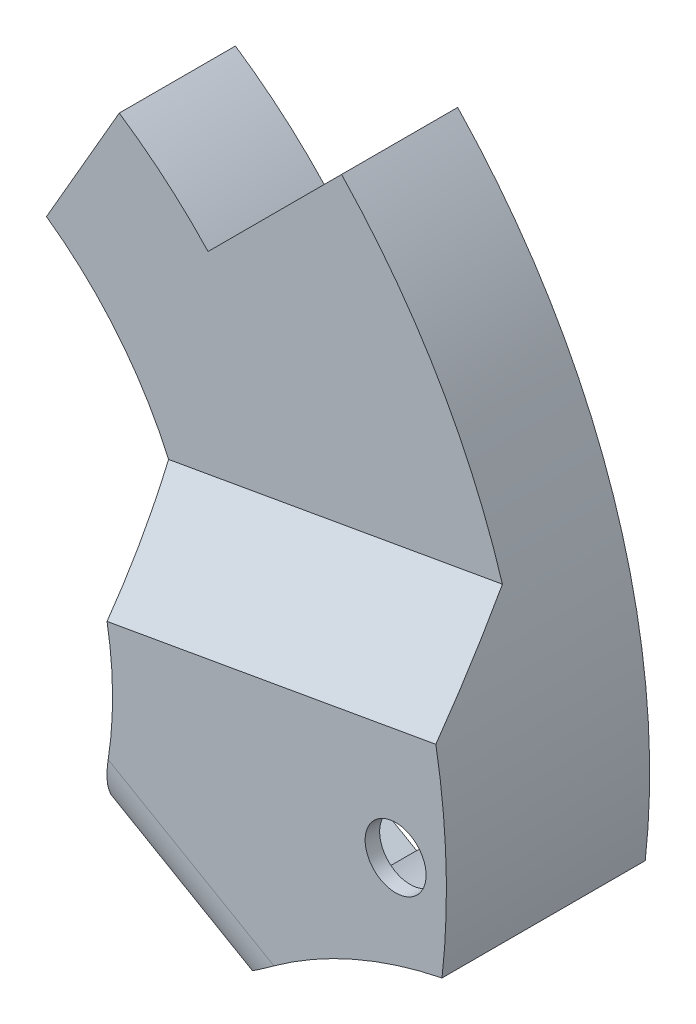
ISO-10303-21;
HEADER;
FILE_DESCRIPTION(('STEP AP214'),'2;1');
FILE_NAME('part.step','',(''),(''),'','','');
FILE_SCHEMA(('AUTOMOTIVE_DESIGN { 1 0 10303 214 1 1 1 1 }'));
ENDSEC;
DATA;
#1=APPLICATION_CONTEXT('core data for automotive mechanical design processes');
#2=APPLICATION_PROTOCOL_DEFINITION('international standard','automotive_design',2000,#1);
#3=PRODUCT_CONTEXT('',#1,'mechanical');
#4=PRODUCT('Part','Part','',(#3));
#5=PRODUCT_RELATED_PRODUCT_CATEGORY('part','',(#4));
#6=PRODUCT_DEFINITION_FORMATION('','',#4);
#7=PRODUCT_DEFINITION_CONTEXT('part definition',#1,'design');
#8=PRODUCT_DEFINITION('design','',#6,#7);
#9=PRODUCT_DEFINITION_SHAPE('','',#8);
#10=(LENGTH_UNIT() NAMED_UNIT(*) SI_UNIT(.MILLI.,.METRE.));
#11=(NAMED_UNIT(*) PLANE_ANGLE_UNIT() SI_UNIT($,.RADIAN.));
#12=(NAMED_UNIT(*) SI_UNIT($,.STERADIAN.) SOLID_ANGLE_UNIT());
#13=UNCERTAINTY_MEASURE_WITH_UNIT(LENGTH_MEASURE(1.E-05),#10,'distance_accuracy_value','');
#14=(GEOMETRIC_REPRESENTATION_CONTEXT(3) GLOBAL_UNCERTAINTY_ASSIGNED_CONTEXT((#13)) GLOBAL_UNIT_ASSIGNED_CONTEXT((#10,
#11,#12)) REPRESENTATION_CONTEXT('',''));
#15=CARTESIAN_POINT('',(0.,0.,0.));
#16=DIRECTION('',(0.,0.,1.));
#17=DIRECTION('',(1.,0.,0.));
#18=AXIS2_PLACEMENT_3D('',#15,#16,#17);
#19=CARTESIAN_POINT('',(0.,0.,0.));
#20=DIRECTION('',(0.,0.,1.));
#21=DIRECTION('',(1.,0.,0.));
#22=AXIS2_PLACEMENT_3D('',#19,#20,#21);
#23=PLANE('',#22);
#24=DIRECTION('',(0.500000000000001,0.866025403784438,0.));
#25=VECTOR('',#24,1.);
#26=CARTESIAN_POINT('',(1.99999999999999,-1.15470053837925,0.));
#27=LINE('',#26,#25);
#28=CARTESIAN_POINT('',(14.4465524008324,20.4033605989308,0.));
#29=VERTEX_POINT('',#28);
#30=CARTESIAN_POINT('',(14.8942609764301,21.1788145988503,0.));
#31=VERTEX_POINT('',#30);
#32=EDGE_CURVE('E208',#29,#31,#27,.T.);
#33=ORIENTED_EDGE('',*,*,#32,.T.);
#34=DIRECTION('',(0.866025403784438,-0.500000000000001,0.));
#35=VECTOR('',#34,1.);
#36=CARTESIAN_POINT('',(7.10003234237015,25.6788145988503,0.));
#37=LINE('',#36,#35);
#38=CARTESIAN_POINT('',(15.7602863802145,20.6788145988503,0.));
#39=VERTEX_POINT('',#38);
#40=EDGE_CURVE('E190',#31,#39,#37,.T.);
#41=ORIENTED_EDGE('',*,*,#40,.T.);
#42=CARTESIAN_POINT('',(0.,0.,0.));
#43=DIRECTION('',(0.,0.,1.));
#44=DIRECTION('',(1.,0.,0.));
#45=AXIS2_PLACEMENT_3D('',#42,#43,#44);
#46=CIRCLE('',#45,26.);
#47=CARTESIAN_POINT('',(24.5963797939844,-8.42722380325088,0.));
#48=VERTEX_POINT('',#47);
#49=EDGE_CURVE('E205',#48,#39,#46,.T.);
#50=ORIENTED_EDGE('',*,*,#49,.F.);
#51=DIRECTION('',(0.866025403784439,-0.5,0.));
#52=VECTOR('',#51,1.);
#53=CARTESIAN_POINT('',(2.5,4.33012701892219,0.));
#54=LINE('',#53,#52);
#55=CARTESIAN_POINT('',(31.9456580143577,-12.6703315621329,0.));
#56=VERTEX_POINT('',#55);
#57=EDGE_CURVE('E215',#48,#56,#54,.T.);
#58=ORIENTED_EDGE('',*,*,#57,.T.);
#59=CARTESIAN_POINT('',(53.6576621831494,-34.7969868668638,0.));
#60=DIRECTION('',(0.,0.,1.));
#61=DIRECTION('',(1.,0.,0.));
#62=AXIS2_PLACEMENT_3D('',#59,#60,#61);
#63=CIRCLE('',#62,31.);
#64=CARTESIAN_POINT('',(46.7772756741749,-4.57017291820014,0.));
#65=VERTEX_POINT('',#64);
#66=EDGE_CURVE('E218',#56,#65,#63,.F.);
#67=ORIENTED_EDGE('',*,*,#66,.T.);
#68=CARTESIAN_POINT('',(0.,0.,0.));
#69=DIRECTION('',(0.,0.,1.));
#70=DIRECTION('',(1.,0.,0.));
#71=AXIS2_PLACEMENT_3D('',#68,#69,#70);
#72=CIRCLE('',#71,47.);
#73=CARTESIAN_POINT('',(34.7501476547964,31.6453351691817,0.));
#74=VERTEX_POINT('',#73);
#75=EDGE_CURVE('E354',#65,#74,#72,.T.);
#76=ORIENTED_EDGE('',*,*,#75,.T.);
#77=DIRECTION('',(0.707106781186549,0.707106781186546,0.));
#78=VECTOR('',#77,1.);
#79=CARTESIAN_POINT('',(1.55240624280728,-1.55240624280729,0.));
#80=LINE('',#79,#78);
#81=CARTESIAN_POINT('',(25.5438637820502,22.4390512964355,0.));
#82=VERTEX_POINT('',#81);
#83=EDGE_CURVE('E221',#82,#74,#80,.T.);
#84=ORIENTED_EDGE('',*,*,#83,.F.);
#85=CARTESIAN_POINT('',(0.,0.,0.));
#86=DIRECTION('',(0.,0.,1.));
#87=DIRECTION('',(1.,0.,0.));
#88=AXIS2_PLACEMENT_3D('',#85,#86,#87);
#89=CIRCLE('',#88,34.);
#90=CARTESIAN_POINT('',(19.7853033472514,27.650348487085,0.));
#91=VERTEX_POINT('',#90);
#92=EDGE_CURVE('E216',#82,#91,#89,.T.);
#93=ORIENTED_EDGE('',*,*,#92,.T.);
#94=DIRECTION('',(0.866025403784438,-0.500000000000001,0.));
#95=VECTOR('',#94,1.);
#96=CARTESIAN_POINT('',(11.125049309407,32.650348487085,0.));
#97=LINE('',#96,#95);
#98=CARTESIAN_POINT('',(18.919277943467,28.150348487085,0.));
#99=VERTEX_POINT('',#98);
#100=EDGE_CURVE('E209',#99,#91,#97,.T.);
#101=ORIENTED_EDGE('',*,*,#100,.F.);
#102=CARTESIAN_POINT('',(19.4618632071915,29.090133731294,0.));
#103=VERTEX_POINT('',#102);
#104=EDGE_CURVE('E257',#99,#103,#27,.T.);
#105=ORIENTED_EDGE('',*,*,#104,.T.);
#106=CARTESIAN_POINT('',(0.,0.,0.));
#107=DIRECTION('',(0.,0.,1.));
#108=DIRECTION('',(1.,0.,0.));
#109=AXIS2_PLACEMENT_3D('',#106,#107,#108);
#110=CIRCLE('',#109,35.);
#111=CARTESIAN_POINT('',(25.5795968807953,23.8889979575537,0.));
#112=VERTEX_POINT('',#111);
#113=EDGE_CURVE('E254',#112,#103,#110,.T.);
#114=ORIENTED_EDGE('',*,*,#113,.F.);
#115=DIRECTION('',(0.707106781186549,0.707106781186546,0.));
#116=VECTOR('',#115,1.);
#117=CARTESIAN_POINT('',(0.845299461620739,-0.845299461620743,0.));
#118=LINE('',#117,#116);
#119=CARTESIAN_POINT('',(34.7758972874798,33.0852983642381,0.));
#120=VERTEX_POINT('',#119);
#121=EDGE_CURVE('E237',#112,#120,#118,.T.);
#122=ORIENTED_EDGE('',*,*,#121,.T.);
#123=CARTESIAN_POINT('',(0.,0.,0.));
#124=DIRECTION('',(0.,0.,1.));
#125=DIRECTION('',(1.,0.,0.));
#126=AXIS2_PLACEMENT_3D('',#123,#124,#125);
#127=CIRCLE('',#126,48.);
#128=CARTESIAN_POINT('',(47.6958091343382,-5.39534901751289,0.));
#129=VERTEX_POINT('',#128);
#130=EDGE_CURVE('E242',#129,#120,#127,.T.);
#131=ORIENTED_EDGE('',*,*,#130,.F.);
#132=CARTESIAN_POINT('',(53.6576621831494,-34.7969868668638,0.));
#133=DIRECTION('',(0.,0.,1.));
#134=DIRECTION('',(1.,0.,0.));
#135=AXIS2_PLACEMENT_3D('',#132,#133,#134);
#136=CIRCLE('',#135,30.);
#137=CARTESIAN_POINT('',(32.1122898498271,-13.921237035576,0.));
#138=VERTEX_POINT('',#137);
#139=EDGE_CURVE('E264',#138,#129,#136,.F.);
#140=ORIENTED_EDGE('',*,*,#139,.F.);
#141=DIRECTION('',(0.866025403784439,-0.5,0.));
#142=VECTOR('',#141,1.);
#143=CARTESIAN_POINT('',(2.,3.46410161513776,0.));
#144=LINE('',#143,#142);
#145=CARTESIAN_POINT('',(23.3717102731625,-8.87486106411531,0.));
#146=VERTEX_POINT('',#145);
#147=EDGE_CURVE('E261',#146,#138,#144,.T.);
#148=ORIENTED_EDGE('',*,*,#147,.F.);
#149=CARTESIAN_POINT('',(0.,0.,0.));
#150=DIRECTION('',(0.,0.,1.));
#151=DIRECTION('',(1.,0.,0.));
#152=AXIS2_PLACEMENT_3D('',#149,#150,#151);
#153=CIRCLE('',#152,25.);
#154=EDGE_CURVE('E259',#146,#29,#153,.T.);
#155=ORIENTED_EDGE('',*,*,#154,.T.);
#156=EDGE_LOOP('',(#33,#41,#50,#58,#67,#76,#84,#93,#101,#105,#114,#122,#131,#140,#148,#155));
#157=FACE_BOUND('',#156,.T.);
#158=ADVANCED_FACE('F38',(#157),#23,.F.);
#159=CARTESIAN_POINT('',(0.,0.,8.));
#160=DIRECTION('',(0.,0.,1.));
#161=DIRECTION('',(1.,0.,0.));
#162=AXIS2_PLACEMENT_3D('',#159,#160,#161);
#163=PLANE('',#162);
#164=CARTESIAN_POINT('',(0.,0.,8.));
#165=DIRECTION('',(0.,0.,1.));
#166=DIRECTION('',(1.,0.,0.));
#167=AXIS2_PLACEMENT_3D('',#164,#165,#166);
#168=CIRCLE('',#167,25.);
#169=CARTESIAN_POINT('',(22.8587275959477,10.1231700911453,8.));
#170=VERTEX_POINT('',#169);
#171=CARTESIAN_POINT('',(14.4465524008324,20.4033605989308,8.));
#172=VERTEX_POINT('',#171);
#173=EDGE_CURVE('E247',#170,#172,#168,.T.);
#174=ORIENTED_EDGE('',*,*,#173,.F.);
#175=DIRECTION('',(0.984807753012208,0.173648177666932,0.));
#176=VECTOR('',#175,1.);
#177=CARTESIAN_POINT('',(46.2288830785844,14.243959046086,8.));
#178=LINE('',#177,#176);
#179=CARTESIAN_POINT('',(45.8581262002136,14.178584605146,8.));
#180=VERTEX_POINT('',#179);
#181=EDGE_CURVE('E283',#170,#180,#178,.T.);
#182=ORIENTED_EDGE('',*,*,#181,.T.);
#183=CARTESIAN_POINT('',(0.,0.,8.));
#184=DIRECTION('',(0.,0.,1.));
#185=DIRECTION('',(1.,0.,0.));
#186=AXIS2_PLACEMENT_3D('',#183,#184,#185);
#187=CIRCLE('',#186,48.);
#188=CARTESIAN_POINT('',(34.7758972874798,33.0852983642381,8.));
#189=VERTEX_POINT('',#188);
#190=EDGE_CURVE('E249',#180,#189,#187,.T.);
#191=ORIENTED_EDGE('',*,*,#190,.T.);
#192=DIRECTION('',(0.707106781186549,0.707106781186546,0.));
#193=VECTOR('',#192,1.);
#194=CARTESIAN_POINT('',(0.845299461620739,-0.845299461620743,8.));
#195=LINE('',#194,#193);
#196=CARTESIAN_POINT('',(25.5795968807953,23.8889979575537,8.));
#197=VERTEX_POINT('',#196);
#198=EDGE_CURVE('E238',#197,#189,#195,.T.);
#199=ORIENTED_EDGE('',*,*,#198,.F.);
#200=CARTESIAN_POINT('',(0.,0.,8.));
#201=DIRECTION('',(0.,0.,1.));
#202=DIRECTION('',(1.,0.,0.));
#203=AXIS2_PLACEMENT_3D('',#200,#201,#202);
#204=CIRCLE('',#203,35.);
#205=CARTESIAN_POINT('',(19.4618632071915,29.090133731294,8.));
#206=VERTEX_POINT('',#205);
#207=EDGE_CURVE('E241',#197,#206,#204,.T.);
#208=ORIENTED_EDGE('',*,*,#207,.T.);
#209=DIRECTION('',(0.500000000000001,0.866025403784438,0.));
#210=VECTOR('',#209,1.);
#211=CARTESIAN_POINT('',(1.99999999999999,-1.15470053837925,8.));
#212=LINE('',#211,#210);
#213=EDGE_CURVE('E244',#172,#206,#212,.T.);
#214=ORIENTED_EDGE('',*,*,#213,.F.);
#215=EDGE_LOOP('',(#174,#182,#191,#199,#208,#214));
#216=FACE_BOUND('',#215,.T.);
#217=ADVANCED_FACE('F479',(#216),#163,.T.);
#218=CARTESIAN_POINT('',(0.845299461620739,-0.845299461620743,8.));
#219=DIRECTION('',(-0.707106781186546,0.707106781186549,0.));
#220=DIRECTION('',(-0.707106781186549,-0.707106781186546,0.));
#221=AXIS2_PLACEMENT_3D('',#218,#219,#220);
#222=PLANE('',#221);
#223=ORIENTED_EDGE('',*,*,#121,.F.);
#224=DIRECTION('',(0.,0.,-1.));
#225=VECTOR('',#224,1.);
#226=CARTESIAN_POINT('',(25.5795968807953,23.8889979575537,8.));
#227=LINE('',#226,#225);
#228=EDGE_CURVE('E281',#197,#112,#227,.T.);
#229=ORIENTED_EDGE('',*,*,#228,.F.);
#230=ORIENTED_EDGE('',*,*,#198,.T.);
#231=DIRECTION('',(0.,0.,-1.));
#232=VECTOR('',#231,1.);
#233=CARTESIAN_POINT('',(34.7758972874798,33.0852983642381,8.));
#234=LINE('',#233,#232);
#235=EDGE_CURVE('E251',#189,#120,#234,.T.);
#236=ORIENTED_EDGE('',*,*,#235,.T.);
#237=EDGE_LOOP('',(#223,#229,#230,#236));
#238=FACE_BOUND('',#237,.T.);
#239=ADVANCED_FACE('F455',(#238),#222,.T.);
#240=CARTESIAN_POINT('',(0.,0.,8.));
#241=DIRECTION('',(0.,0.,-1.));
#242=DIRECTION('',(-1.,0.,0.));
#243=AXIS2_PLACEMENT_3D('',#240,#241,#242);
#244=CYLINDRICAL_SURFACE('',#243,35.);
#245=ORIENTED_EDGE('',*,*,#113,.T.);
#246=DIRECTION('',(0.,0.,-1.));
#247=VECTOR('',#246,1.);
#248=CARTESIAN_POINT('',(19.4618632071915,29.090133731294,8.));
#249=LINE('',#248,#247);
#250=EDGE_CURVE('E278',#206,#103,#249,.T.);
#251=ORIENTED_EDGE('',*,*,#250,.F.);
#252=ORIENTED_EDGE('',*,*,#207,.F.);
#253=ORIENTED_EDGE('',*,*,#228,.T.);
#254=EDGE_LOOP('',(#245,#251,#252,#253));
#255=FACE_BOUND('',#254,.T.);
#256=ADVANCED_FACE('F481',(#255),#244,.T.);
#257=CARTESIAN_POINT('',(1.99999999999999,-1.15470053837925,8.));
#258=DIRECTION('',(-0.866025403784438,0.500000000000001,0.));
#259=DIRECTION('',(-0.500000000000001,-0.866025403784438,0.));
#260=AXIS2_PLACEMENT_3D('',#257,#258,#259);
#261=PLANE('',#260);
#262=DIRECTION('',(0.,0.,1.));
#263=VECTOR('',#262,1.);
#264=CARTESIAN_POINT('',(14.8942609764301,21.1788145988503,8.));
#265=LINE('',#264,#263);
#266=CARTESIAN_POINT('',(14.8942609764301,21.1788145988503,7.));
#267=VERTEX_POINT('',#266);
#268=EDGE_CURVE('E443',#31,#267,#265,.T.);
#269=ORIENTED_EDGE('',*,*,#268,.F.);
#270=ORIENTED_EDGE('',*,*,#32,.F.);
#271=DIRECTION('',(0.,0.,-1.));
#272=VECTOR('',#271,1.);
#273=CARTESIAN_POINT('',(14.4465524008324,20.4033605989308,8.));
#274=LINE('',#273,#272);
#275=EDGE_CURVE('E276',#172,#29,#274,.T.);
#276=ORIENTED_EDGE('',*,*,#275,.F.);
#277=ORIENTED_EDGE('',*,*,#213,.T.);
#278=ORIENTED_EDGE('',*,*,#250,.T.);
#279=ORIENTED_EDGE('',*,*,#104,.F.);
#280=DIRECTION('',(0.,0.,-1.));
#281=VECTOR('',#280,1.);
#282=CARTESIAN_POINT('',(18.919277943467,28.150348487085,8.));
#283=LINE('',#282,#281);
#284=CARTESIAN_POINT('',(18.919277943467,28.150348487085,7.));
#285=VERTEX_POINT('',#284);
#286=EDGE_CURVE('E336',#285,#99,#283,.T.);
#287=ORIENTED_EDGE('',*,*,#286,.F.);
#288=DIRECTION('',(0.500000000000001,0.866025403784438,0.));
#289=VECTOR('',#288,1.);
#290=CARTESIAN_POINT('',(1.99999999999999,-1.15470053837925,7.));
#291=LINE('',#290,#289);
#292=EDGE_CURVE('E441',#267,#285,#291,.T.);
#293=ORIENTED_EDGE('',*,*,#292,.F.);
#294=EDGE_LOOP('',(#269,#270,#276,#277,#278,#279,#287,#293));
#295=FACE_BOUND('',#294,.T.);
#296=ADVANCED_FACE('F314',(#295),#261,.T.);
#297=CARTESIAN_POINT('',(0.,0.,8.));
#298=DIRECTION('',(0.,0.,-1.));
#299=DIRECTION('',(-1.,0.,0.));
#300=AXIS2_PLACEMENT_3D('',#297,#298,#299);
#301=CYLINDRICAL_SURFACE('',#300,25.);
#302=DIRECTION('',(0.,0.,-1.));
#303=VECTOR('',#302,1.);
#304=CARTESIAN_POINT('',(23.3717102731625,-8.87486106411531,8.));
#305=LINE('',#304,#303);
#306=CARTESIAN_POINT('',(23.3717102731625,-8.87486106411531,9.));
#307=VERTEX_POINT('',#306);
#308=EDGE_CURVE('E274',#307,#146,#305,.T.);
#309=ORIENTED_EDGE('',*,*,#308,.F.);
#310=CARTESIAN_POINT('',(23.3717102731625,-8.87486106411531,9.));
#311=CARTESIAN_POINT('',(23.3716969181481,-8.87487172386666,9.13876717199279));
#312=CARTESIAN_POINT('',(23.3737873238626,-8.86939043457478,9.27753236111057));
#313=CARTESIAN_POINT('',(23.382079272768,-8.84752066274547,9.55407116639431));
#314=CARTESIAN_POINT('',(23.3882806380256,-8.83113265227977,9.69184482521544));
#315=CARTESIAN_POINT('',(23.4046917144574,-8.78754319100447,9.96531811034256));
#316=CARTESIAN_POINT('',(23.4148982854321,-8.76035021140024,10.10101927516));
#317=CARTESIAN_POINT('',(23.4391319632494,-8.69530358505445,10.3694918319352));
#318=CARTESIAN_POINT('',(23.4531590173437,-8.65745008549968,10.5022632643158));
#319=CARTESIAN_POINT('',(23.484788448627,-8.57127847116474,10.7639788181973));
#320=CARTESIAN_POINT('',(23.5023920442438,-8.52295678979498,10.8929216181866));
#321=CARTESIAN_POINT('',(23.5408632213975,-8.41611443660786,11.1460626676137));
#322=CARTESIAN_POINT('',(23.5617320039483,-8.35759001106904,11.270259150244));
#323=CARTESIAN_POINT('',(23.6063446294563,-8.23073560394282,11.5129098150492));
#324=CARTESIAN_POINT('',(23.6300868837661,-8.16241103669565,11.6313671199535));
#325=CARTESIAN_POINT('',(23.680045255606,-8.01632182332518,11.8618224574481));
#326=CARTESIAN_POINT('',(23.7062622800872,-7.93855371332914,11.9738180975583));
#327=CARTESIAN_POINT('',(23.7606869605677,-7.77413955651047,12.1904566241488));
#328=CARTESIAN_POINT('',(23.7888933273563,-7.68749924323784,12.295104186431));
#329=CARTESIAN_POINT('',(23.8468376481,-7.50582608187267,12.4964551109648));
#330=CARTESIAN_POINT('',(23.8765761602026,-7.41079016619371,12.5931555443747));
#331=CARTESIAN_POINT('',(23.9370627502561,-7.21302377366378,12.7779012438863));
#332=CARTESIAN_POINT('',(23.9678104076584,-7.11029647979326,12.8659500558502));
#333=CARTESIAN_POINT('',(24.029836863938,-6.89776749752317,13.0329265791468));
#334=CARTESIAN_POINT('',(24.0611158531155,-6.78796323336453,13.1118509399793));
#335=CARTESIAN_POINT('',(24.1239206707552,-6.56127853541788,13.2606091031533));
#336=CARTESIAN_POINT('',(24.1554467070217,-6.44435431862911,13.3303760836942));
#337=CARTESIAN_POINT('',(24.2180640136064,-6.20489311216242,13.4598427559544));
#338=CARTESIAN_POINT('',(24.2491551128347,-6.08235399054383,13.5195385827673));
#339=CARTESIAN_POINT('',(24.3104506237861,-5.83253966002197,13.6285821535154));
#340=CARTESIAN_POINT('',(24.3406550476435,-5.70526451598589,13.6779300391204));
#341=CARTESIAN_POINT('',(24.3997868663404,-5.44683492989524,13.7661421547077));
#342=CARTESIAN_POINT('',(24.4287138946,-5.31567939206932,13.8050033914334));
#343=CARTESIAN_POINT('',(24.5021715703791,-4.96902824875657,13.8927430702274));
#344=CARTESIAN_POINT('',(24.5454162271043,-4.7510437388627,13.9331949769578));
#345=CARTESIAN_POINT('',(24.6061971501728,-4.42126754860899,13.973408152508));
#346=CARTESIAN_POINT('',(24.6257622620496,-4.31096597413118,13.9834019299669));
#347=CARTESIAN_POINT('',(24.6634708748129,-4.08971833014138,13.9966961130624));
#348=CARTESIAN_POINT('',(24.6816143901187,-3.97877226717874,13.9999965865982));
#349=CARTESIAN_POINT('',(24.6990098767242,-3.86767515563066,14.));
#350=B_SPLINE_CURVE_WITH_KNOTS('',3,(#310,#311,#312,#313,#314,#315,#316,#317,#318,#319,#320,
#321,#322,#323,#324,#325,#326,#327,#328,#329,#330,#331,#332,#333,#334,#335,#336,#337,#338,#339,
#340,#341,#342,#343,#344,#345,#346,#347,#348,#349),.UNSPECIFIED.,.F.,.F.,(4,2,2,2,2,2,2,2,2,2,2,
2,2,2,2,2,2,2,2,4),(0.,0.416174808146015,0.832331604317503,1.24816277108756,1.66398819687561,
2.07995552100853,2.49607620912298,2.91196787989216,3.32801256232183,3.74379005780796,
4.15972010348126,4.57547896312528,4.99139000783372,5.41018470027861,5.82913974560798,
6.24808905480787,6.66715782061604,7.34271700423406,7.679951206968,8.01718198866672),.UNSPECIFIED.);
#351=CARTESIAN_POINT('',(24.6990098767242,-3.86767515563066,14.));
#352=VERTEX_POINT('',#351);
#353=EDGE_CURVE('E47',#307,#352,#350,.T.);
#354=ORIENTED_EDGE('',*,*,#353,.T.);
#355=CARTESIAN_POINT('',(0.,0.,14.));
#356=DIRECTION('',(0.,0.,1.));
#357=DIRECTION('',(1.,0.,0.));
#358=AXIS2_PLACEMENT_3D('',#355,#356,#357);
#359=CIRCLE('',#358,25.);
#360=CARTESIAN_POINT('',(24.6201938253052,4.34120444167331,14.));
#361=VERTEX_POINT('',#360);
#362=EDGE_CURVE('E228',#361,#352,#359,.F.);
#363=ORIENTED_EDGE('',*,*,#362,.F.);
#364=CARTESIAN_POINT('',(0.,0.,14.));
#365=DIRECTION('',(-0.122787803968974,0.696364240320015,0.707106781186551));
#366=DIRECTION('',(-0.122787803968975,0.696364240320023,-0.707106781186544));
#367=AXIS2_PLACEMENT_3D('',#364,#365,#366);
#368=ELLIPSE('',#367,35.3553390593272,25.);
#369=EDGE_CURVE('E288',#361,#170,#368,.T.);
#370=ORIENTED_EDGE('',*,*,#369,.T.);
#371=ORIENTED_EDGE('',*,*,#173,.T.);
#372=ORIENTED_EDGE('',*,*,#275,.T.);
#373=ORIENTED_EDGE('',*,*,#154,.F.);
#374=EDGE_LOOP('',(#309,#354,#363,#370,#371,#372,#373));
#375=FACE_BOUND('',#374,.T.);
#376=ADVANCED_FACE('F310',(#375),#301,.F.);
#377=CARTESIAN_POINT('',(2.,3.46410161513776,8.));
#378=DIRECTION('',(0.5,0.866025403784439,0.));
#379=DIRECTION('',(-0.866025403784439,0.5,0.));
#380=AXIS2_PLACEMENT_3D('',#377,#378,#379);
#381=PLANE('',#380);
#382=DIRECTION('',(0.,0.,-1.));
#383=VECTOR('',#382,1.);
#384=CARTESIAN_POINT('',(32.1122898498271,-13.921237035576,8.));
#385=LINE('',#384,#383);
#386=CARTESIAN_POINT('',(32.1122898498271,-13.921237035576,9.));
#387=VERTEX_POINT('',#386);
#388=EDGE_CURVE('E272',#387,#138,#385,.T.);
#389=ORIENTED_EDGE('',*,*,#388,.F.);
#390=DIRECTION('',(0.866025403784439,-0.5,0.));
#391=VECTOR('',#390,1.);
#392=CARTESIAN_POINT('',(23.3717102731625,-8.87486106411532,9.));
#393=LINE('',#392,#391);
#394=EDGE_CURVE('E54',#387,#307,#393,.F.);
#395=ORIENTED_EDGE('',*,*,#394,.T.);
#396=ORIENTED_EDGE('',*,*,#308,.T.);
#397=ORIENTED_EDGE('',*,*,#147,.T.);
#398=EDGE_LOOP('',(#389,#395,#396,#397));
#399=FACE_BOUND('',#398,.T.);
#400=ADVANCED_FACE('F306',(#399),#381,.F.);
#401=CARTESIAN_POINT('',(53.6576621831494,-34.7969868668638,8.));
#402=DIRECTION('',(0.,0.,-1.));
#403=DIRECTION('',(-1.,0.,0.));
#404=AXIS2_PLACEMENT_3D('',#401,#402,#403);
#405=CYLINDRICAL_SURFACE('',#404,30.);
#406=CARTESIAN_POINT('',(53.6576621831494,-34.7969868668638,14.));
#407=DIRECTION('',(0.,0.,1.));
#408=DIRECTION('',(1.,0.,0.));
#409=AXIS2_PLACEMENT_3D('',#406,#407,#408);
#410=CIRCLE('',#409,30.);
#411=CARTESIAN_POINT('',(36.1165382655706,-10.4595882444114,14.));
#412=VERTEX_POINT('',#411);
#413=CARTESIAN_POINT('',(47.6958091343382,-5.39534901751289,14.));
#414=VERTEX_POINT('',#413);
#415=EDGE_CURVE('E232',#412,#414,#410,.F.);
#416=ORIENTED_EDGE('',*,*,#415,.F.);
#417=CARTESIAN_POINT('',(36.1165382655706,-10.4595882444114,14.));
#418=CARTESIAN_POINT('',(35.9900644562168,-10.5507298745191,14.0000106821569));
#419=CARTESIAN_POINT('',(35.8642963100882,-10.6428884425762,13.9939362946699));
#420=CARTESIAN_POINT('',(35.6149364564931,-10.8285901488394,13.9694257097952));
#421=CARTESIAN_POINT('',(35.4913455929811,-10.9221337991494,13.9509848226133));
#422=CARTESIAN_POINT('',(35.2469024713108,-11.1101169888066,13.9014884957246));
#423=CARTESIAN_POINT('',(35.1260576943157,-11.2045581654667,13.8704021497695));
#424=CARTESIAN_POINT('',(34.888267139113,-11.3932940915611,13.7955304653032));
#425=CARTESIAN_POINT('',(34.7713208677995,-11.4875888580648,13.7517467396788));
#426=CARTESIAN_POINT('',(34.5418117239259,-11.6754316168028,13.6513508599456));
#427=CARTESIAN_POINT('',(34.4292622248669,-11.7689767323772,13.5947026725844));
#428=CARTESIAN_POINT('',(34.2097211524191,-11.9540841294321,13.4687952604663));
#429=CARTESIAN_POINT('',(34.102729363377,-12.0456464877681,13.3995365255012));
#430=CARTESIAN_POINT('',(33.8952304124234,-12.2256525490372,13.2488020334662));
#431=CARTESIAN_POINT('',(33.7947145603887,-12.3141003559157,13.1673431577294));
#432=CARTESIAN_POINT('',(33.6007534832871,-12.4869601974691,12.9925892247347));
#433=CARTESIAN_POINT('',(33.5073077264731,-12.5713725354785,12.8992950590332));
#434=CARTESIAN_POINT('',(33.3336982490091,-12.7300554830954,12.7075910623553));
#435=CARTESIAN_POINT('',(33.2530707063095,-12.804630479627,12.6098525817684));
#436=CARTESIAN_POINT('',(33.0991445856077,-12.9484525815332,12.405125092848));
#437=CARTESIAN_POINT('',(33.0258455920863,-13.0176999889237,12.2981366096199));
#438=CARTESIAN_POINT('',(32.8869989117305,-13.1500758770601,12.0756149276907));
#439=CARTESIAN_POINT('',(32.8214538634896,-13.2132022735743,11.9600788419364));
#440=CARTESIAN_POINT('',(32.6985324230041,-13.3325460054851,11.7213500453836));
#441=CARTESIAN_POINT('',(32.6411556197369,-13.3887636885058,11.5981577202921));
#442=CARTESIAN_POINT('',(32.5374535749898,-13.4910760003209,11.3511631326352));
#443=CARTESIAN_POINT('',(32.4907291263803,-13.5375278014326,11.2276760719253));
#444=CARTESIAN_POINT('',(32.4052009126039,-13.6230276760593,10.9755096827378));
#445=CARTESIAN_POINT('',(32.3663967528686,-13.6620761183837,10.8468306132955));
#446=CARTESIAN_POINT('',(32.2969194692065,-13.7322980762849,10.5853270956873));
#447=CARTESIAN_POINT('',(32.2662392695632,-13.7634784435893,10.4525063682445));
#448=CARTESIAN_POINT('',(32.213110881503,-13.8176482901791,10.1836378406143));
#449=CARTESIAN_POINT('',(32.1906600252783,-13.8406404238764,10.0475911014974));
#450=CARTESIAN_POINT('',(32.1523607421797,-13.8799391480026,9.76036310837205));
#451=CARTESIAN_POINT('',(32.1373282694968,-13.895417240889,9.6089583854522));
#452=CARTESIAN_POINT('',(32.1172957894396,-13.9160710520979,9.30503332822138));
#453=CARTESIAN_POINT('',(32.1122798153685,-13.9212631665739,9.15251515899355));
#454=CARTESIAN_POINT('',(32.1122898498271,-13.921237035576,9.));
#455=B_SPLINE_CURVE_WITH_KNOTS('',3,(#417,#418,#419,#420,#421,#422,#423,#424,#425,#426,#427,
#428,#429,#430,#431,#432,#433,#434,#435,#436,#437,#438,#439,#440,#441,#442,#443,#444,#445,#446,
#447,#448,#449,#450,#451,#452,#453,#454),.UNSPECIFIED.,.F.,.F.,(4,2,2,2,2,2,2,2,2,2,2,2,2,2,2,2,
2,2,4),(0.,0.467586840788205,0.935351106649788,1.40426555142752,1.87312045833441,
2.34330518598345,2.81347165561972,3.28299346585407,3.75247992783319,4.19298345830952,
4.63346199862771,5.07409000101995,5.51469582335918,5.93407865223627,6.35344058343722,
6.77243605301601,7.19129557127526,7.64940978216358,8.10679315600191),.UNSPECIFIED.);
#456=EDGE_CURVE('E62',#412,#387,#455,.T.);
#457=ORIENTED_EDGE('',*,*,#456,.T.);
#458=ORIENTED_EDGE('',*,*,#388,.T.);
#459=ORIENTED_EDGE('',*,*,#139,.T.);
#460=DIRECTION('',(0.,0.,-1.));
#461=VECTOR('',#460,1.);
#462=CARTESIAN_POINT('',(47.6958091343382,-5.39534901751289,8.));
#463=LINE('',#462,#461);
#464=EDGE_CURVE('E269',#414,#129,#463,.T.);
#465=ORIENTED_EDGE('',*,*,#464,.F.);
#466=EDGE_LOOP('',(#416,#457,#458,#459,#465));
#467=FACE_BOUND('',#466,.T.);
#468=ADVANCED_FACE('F300',(#467),#405,.F.);
#469=CARTESIAN_POINT('',(0.,0.,8.));
#470=DIRECTION('',(0.,0.,-1.));
#471=DIRECTION('',(-1.,0.,0.));
#472=AXIS2_PLACEMENT_3D('',#469,#470,#471);
#473=CYLINDRICAL_SURFACE('',#472,48.);
#474=ORIENTED_EDGE('',*,*,#130,.T.);
#475=ORIENTED_EDGE('',*,*,#235,.F.);
#476=ORIENTED_EDGE('',*,*,#190,.F.);
#477=CARTESIAN_POINT('',(0.,0.,14.));
#478=DIRECTION('',(-0.122787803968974,0.696364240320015,0.707106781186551));
#479=DIRECTION('',(-0.122787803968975,0.696364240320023,-0.707106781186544));
#480=AXIS2_PLACEMENT_3D('',#477,#478,#479);
#481=ELLIPSE('',#480,67.8822509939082,48.);
#482=CARTESIAN_POINT('',(47.270772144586,8.33511252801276,14.));
#483=VERTEX_POINT('',#482);
#484=EDGE_CURVE('E286',#180,#483,#481,.F.);
#485=ORIENTED_EDGE('',*,*,#484,.T.);
#486=CARTESIAN_POINT('',(0.,0.,14.));
#487=DIRECTION('',(0.,0.,1.));
#488=DIRECTION('',(1.,0.,0.));
#489=AXIS2_PLACEMENT_3D('',#486,#487,#488);
#490=CIRCLE('',#489,48.);
#491=EDGE_CURVE('E234',#414,#483,#490,.T.);
#492=ORIENTED_EDGE('',*,*,#491,.F.);
#493=ORIENTED_EDGE('',*,*,#464,.T.);
#494=EDGE_LOOP('',(#474,#475,#476,#485,#492,#493));
#495=FACE_BOUND('',#494,.T.);
#496=ADVANCED_FACE('F305',(#495),#473,.T.);
#497=CARTESIAN_POINT('',(0.,0.,14.));
#498=DIRECTION('',(0.,0.,1.));
#499=DIRECTION('',(1.,0.,0.));
#500=AXIS2_PLACEMENT_3D('',#497,#498,#499);
#501=PLANE('',#500);
#502=CARTESIAN_POINT('',(44.5,0.186886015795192,14.));
#503=DIRECTION('',(0.,0.,1.));
#504=DIRECTION('',(1.,0.,0.));
#505=AXIS2_PLACEMENT_3D('',#502,#503,#504);
#506=CIRCLE('',#505,2.1);
#507=CARTESIAN_POINT('',(46.6,0.186886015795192,14.));
#508=VERTEX_POINT('',#507);
#509=EDGE_CURVE('E324',#508,#508,#506,.T.);
#510=ORIENTED_EDGE('',*,*,#509,.F.);
#511=EDGE_LOOP('',(#510));
#512=FACE_BOUND('',#511,.T.);
#513=ORIENTED_EDGE('',*,*,#362,.T.);
#514=DIRECTION('',(0.866025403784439,-0.5,0.));
#515=VECTOR('',#514,1.);
#516=CARTESIAN_POINT('',(34.6122898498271,-9.59111001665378,14.));
#517=LINE('',#516,#515);
#518=EDGE_CURVE('E290',#352,#412,#517,.T.);
#519=ORIENTED_EDGE('',*,*,#518,.T.);
#520=ORIENTED_EDGE('',*,*,#415,.T.);
#521=ORIENTED_EDGE('',*,*,#491,.T.);
#522=DIRECTION('',(0.984807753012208,0.173648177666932,0.));
#523=VECTOR('',#522,1.);
#524=CARTESIAN_POINT('',(0.,0.,14.));
#525=LINE('',#524,#523);
#526=EDGE_CURVE('E225',#361,#483,#525,.T.);
#527=ORIENTED_EDGE('',*,*,#526,.F.);
#528=EDGE_LOOP('',(#513,#519,#520,#521,#527));
#529=FACE_BOUND('',#528,.T.);
#530=ADVANCED_FACE('F470',(#512,#529),#501,.T.);
#531=CARTESIAN_POINT('',(-1.0418890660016,5.90884651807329,8.));
#532=DIRECTION('',(-0.122787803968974,0.696364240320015,0.707106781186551));
#533=DIRECTION('',(-0.984807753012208,-0.173648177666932,0.));
#534=AXIS2_PLACEMENT_3D('',#531,#532,#533);
#535=PLANE('',#534);
#536=ORIENTED_EDGE('',*,*,#369,.F.);
#537=ORIENTED_EDGE('',*,*,#526,.T.);
#538=ORIENTED_EDGE('',*,*,#484,.F.);
#539=ORIENTED_EDGE('',*,*,#181,.F.);
#540=EDGE_LOOP('',(#536,#537,#538,#539));
#541=FACE_BOUND('',#540,.T.);
#542=ADVANCED_FACE('F480',(#541),#535,.T.);
#543=CARTESIAN_POINT('',(4.5,7.79422863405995,9.));
#544=DIRECTION('',(-0.866025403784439,0.5,0.));
#545=DIRECTION('',(-0.5,-0.866025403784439,0.));
#546=AXIS2_PLACEMENT_3D('',#543,#544,#545);
#547=CYLINDRICAL_SURFACE('',#546,5.);
#548=ORIENTED_EDGE('',*,*,#353,.F.);
#549=ORIENTED_EDGE('',*,*,#394,.F.);
#550=ORIENTED_EDGE('',*,*,#456,.F.);
#551=ORIENTED_EDGE('',*,*,#518,.F.);
#552=EDGE_LOOP('',(#548,#549,#550,#551));
#553=FACE_BOUND('',#552,.T.);
#554=ADVANCED_FACE('F40',(#553),#547,.T.);
#555=CARTESIAN_POINT('',(0.,0.,7.));
#556=DIRECTION('',(0.,0.,1.));
#557=DIRECTION('',(1.,0.,0.));
#558=AXIS2_PLACEMENT_3D('',#555,#556,#557);
#559=PLANE('',#558);
#560=CARTESIAN_POINT('',(34.3086256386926,23.5317292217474,7.));
#561=DIRECTION('',(0.,0.,1.));
#562=DIRECTION('',(1.,0.,0.));
#563=AXIS2_PLACEMENT_3D('',#560,#561,#562);
#564=CIRCLE('',#563,1.5);
#565=CARTESIAN_POINT('',(35.8086256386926,23.5317292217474,7.));
#566=VERTEX_POINT('',#565);
#567=EDGE_CURVE('E11',#566,#566,#564,.F.);
#568=ORIENTED_EDGE('',*,*,#567,.F.);
#569=EDGE_LOOP('',(#568));
#570=FACE_BOUND('',#569,.T.);
#571=CARTESIAN_POINT('',(0.,0.,7.));
#572=DIRECTION('',(0.,0.,1.));
#573=DIRECTION('',(1.,0.,0.));
#574=AXIS2_PLACEMENT_3D('',#571,#572,#573);
#575=CIRCLE('',#574,26.);
#576=CARTESIAN_POINT('',(24.0371557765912,9.9103552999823,7.));
#577=VERTEX_POINT('',#576);
#578=CARTESIAN_POINT('',(15.7602863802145,20.6788145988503,7.));
#579=VERTEX_POINT('',#578);
#580=EDGE_CURVE('E340',#577,#579,#575,.T.);
#581=ORIENTED_EDGE('',*,*,#580,.T.);
#582=DIRECTION('',(0.866025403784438,-0.500000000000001,0.));
#583=VECTOR('',#582,1.);
#584=CARTESIAN_POINT('',(7.10003234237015,25.6788145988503,7.));
#585=LINE('',#584,#583);
#586=EDGE_CURVE('E193',#267,#579,#585,.T.);
#587=ORIENTED_EDGE('',*,*,#586,.F.);
#588=ORIENTED_EDGE('',*,*,#292,.T.);
#589=DIRECTION('',(0.866025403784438,-0.500000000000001,0.));
#590=VECTOR('',#589,1.);
#591=CARTESIAN_POINT('',(11.125049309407,32.650348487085,7.));
#592=LINE('',#591,#590);
#593=CARTESIAN_POINT('',(19.7853033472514,27.650348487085,7.));
#594=VERTEX_POINT('',#593);
#595=EDGE_CURVE('E435',#285,#594,#592,.T.);
#596=ORIENTED_EDGE('',*,*,#595,.T.);
#597=CARTESIAN_POINT('',(0.,0.,7.));
#598=DIRECTION('',(0.,0.,1.));
#599=DIRECTION('',(1.,0.,0.));
#600=AXIS2_PLACEMENT_3D('',#597,#598,#599);
#601=CIRCLE('',#600,34.);
#602=CARTESIAN_POINT('',(25.5438637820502,22.4390512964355,7.));
#603=VERTEX_POINT('',#602);
#604=EDGE_CURVE('E343',#603,#594,#601,.T.);
#605=ORIENTED_EDGE('',*,*,#604,.F.);
#606=DIRECTION('',(0.707106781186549,0.707106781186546,0.));
#607=VECTOR('',#606,1.);
#608=CARTESIAN_POINT('',(1.55240624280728,-1.55240624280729,7.));
#609=LINE('',#608,#607);
#610=CARTESIAN_POINT('',(34.7501476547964,31.6453351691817,7.));
#611=VERTEX_POINT('',#610);
#612=EDGE_CURVE('E351',#603,#611,#609,.T.);
#613=ORIENTED_EDGE('',*,*,#612,.T.);
#614=CARTESIAN_POINT('',(0.,0.,7.));
#615=DIRECTION('',(0.,0.,1.));
#616=DIRECTION('',(1.,0.,0.));
#617=AXIS2_PLACEMENT_3D('',#614,#615,#616);
#618=CIRCLE('',#617,47.);
#619=CARTESIAN_POINT('',(44.9879573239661,13.6045468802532,7.));
#620=VERTEX_POINT('',#619);
#621=EDGE_CURVE('E342',#620,#611,#618,.T.);
#622=ORIENTED_EDGE('',*,*,#621,.F.);
#623=DIRECTION('',(-0.984807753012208,-0.173648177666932,0.));
#624=VECTOR('',#623,1.);
#625=CARTESIAN_POINT('',(-0.969961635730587,5.50092579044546,7.));
#626=LINE('',#625,#624);
#627=EDGE_CURVE('E344',#577,#620,#626,.F.);
#628=ORIENTED_EDGE('',*,*,#627,.F.);
#629=EDGE_LOOP('',(#581,#587,#588,#596,#605,#613,#622,#628));
#630=FACE_BOUND('',#629,.T.);
#631=ADVANCED_FACE('F447',(#570,#630),#559,.F.);
#632=CARTESIAN_POINT('',(1.55240624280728,-1.55240624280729,8.));
#633=DIRECTION('',(-0.707106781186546,0.707106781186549,0.));
#634=DIRECTION('',(-0.707106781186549,-0.707106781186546,0.));
#635=AXIS2_PLACEMENT_3D('',#632,#633,#634);
#636=PLANE('',#635);
#637=ORIENTED_EDGE('',*,*,#83,.T.);
#638=DIRECTION('',(0.,0.,-1.));
#639=VECTOR('',#638,1.);
#640=CARTESIAN_POINT('',(34.7501476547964,31.6453351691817,7.));
#641=LINE('',#640,#639);
#642=EDGE_CURVE('E350',#611,#74,#641,.T.);
#643=ORIENTED_EDGE('',*,*,#642,.F.);
#644=ORIENTED_EDGE('',*,*,#612,.F.);
#645=DIRECTION('',(0.,0.,-1.));
#646=VECTOR('',#645,1.);
#647=CARTESIAN_POINT('',(25.5438637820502,22.4390512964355,7.));
#648=LINE('',#647,#646);
#649=EDGE_CURVE('E348',#603,#82,#648,.T.);
#650=ORIENTED_EDGE('',*,*,#649,.T.);
#651=EDGE_LOOP('',(#637,#643,#644,#650));
#652=FACE_BOUND('',#651,.T.);
#653=ADVANCED_FACE('F424',(#652),#636,.F.);
#654=CARTESIAN_POINT('',(0.,0.,8.));
#655=DIRECTION('',(0.,0.,-1.));
#656=DIRECTION('',(-1.,0.,0.));
#657=AXIS2_PLACEMENT_3D('',#654,#655,#656);
#658=CYLINDRICAL_SURFACE('',#657,34.);
#659=ORIENTED_EDGE('',*,*,#92,.F.);
#660=ORIENTED_EDGE('',*,*,#649,.F.);
#661=ORIENTED_EDGE('',*,*,#604,.T.);
#662=DIRECTION('',(0.,0.,-1.));
#663=VECTOR('',#662,1.);
#664=CARTESIAN_POINT('',(19.7853033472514,27.650348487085,7.));
#665=LINE('',#664,#663);
#666=EDGE_CURVE('E198',#594,#91,#665,.T.);
#667=ORIENTED_EDGE('',*,*,#666,.T.);
#668=EDGE_LOOP('',(#659,#660,#661,#667));
#669=FACE_BOUND('',#668,.T.);
#670=ADVANCED_FACE('F429',(#669),#658,.F.);
#671=CARTESIAN_POINT('',(0.,0.,8.));
#672=DIRECTION('',(0.,0.,-1.));
#673=DIRECTION('',(-1.,0.,0.));
#674=AXIS2_PLACEMENT_3D('',#671,#672,#673);
#675=CYLINDRICAL_SURFACE('',#674,26.);
#676=DIRECTION('',(0.,0.,-1.));
#677=VECTOR('',#676,1.);
#678=CARTESIAN_POINT('',(24.5963797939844,-8.42722380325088,9.));
#679=LINE('',#678,#677);
#680=CARTESIAN_POINT('',(24.5963797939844,-8.42722380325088,9.));
#681=VERTEX_POINT('',#680);
#682=EDGE_CURVE('E199',#681,#48,#679,.T.);
#683=ORIENTED_EDGE('',*,*,#682,.T.);
#684=ORIENTED_EDGE('',*,*,#49,.T.);
#685=DIRECTION('',(0.,0.,-1.));
#686=VECTOR('',#685,1.);
#687=CARTESIAN_POINT('',(15.7602863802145,20.6788145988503,7.));
#688=LINE('',#687,#686);
#689=EDGE_CURVE('E187',#579,#39,#688,.T.);
#690=ORIENTED_EDGE('',*,*,#689,.F.);
#691=ORIENTED_EDGE('',*,*,#580,.F.);
#692=CARTESIAN_POINT('',(0.,0.,12.5857864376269));
#693=DIRECTION('',(-0.122787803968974,0.696364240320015,0.707106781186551));
#694=DIRECTION('',(-0.122787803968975,0.696364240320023,-0.707106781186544));
#695=AXIS2_PLACEMENT_3D('',#692,#693,#694);
#696=ELLIPSE('',#695,36.7695526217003,26.);
#697=CARTESIAN_POINT('',(25.673679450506,4.10635890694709,13.));
#698=VERTEX_POINT('',#697);
#699=EDGE_CURVE('E399',#698,#577,#696,.T.);
#700=ORIENTED_EDGE('',*,*,#699,.F.);
#701=CARTESIAN_POINT('',(0.,0.,13.));
#702=DIRECTION('',(0.,0.,1.));
#703=DIRECTION('',(1.,0.,0.));
#704=AXIS2_PLACEMENT_3D('',#701,#702,#703);
#705=CIRCLE('',#704,26.);
#706=CARTESIAN_POINT('',(25.6246301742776,-4.40208228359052,13.));
#707=VERTEX_POINT('',#706);
#708=EDGE_CURVE('E328',#698,#707,#705,.F.);
#709=ORIENTED_EDGE('',*,*,#708,.T.);
#710=CARTESIAN_POINT('',(24.5963797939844,-8.42722380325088,9.));
#711=CARTESIAN_POINT('',(24.5963707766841,-8.42723367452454,9.11058904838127));
#712=CARTESIAN_POINT('',(24.5978942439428,-8.42280309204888,9.22117622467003));
#713=CARTESIAN_POINT('',(24.6039410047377,-8.40513225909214,9.44155579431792));
#714=CARTESIAN_POINT('',(24.6084641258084,-8.39189251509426,9.55134823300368));
#715=CARTESIAN_POINT('',(24.6204391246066,-8.35669204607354,9.76925208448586));
#716=CARTESIAN_POINT('',(24.6278880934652,-8.33473998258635,9.87736505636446));
#717=CARTESIAN_POINT('',(24.6455881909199,-8.28225537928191,10.0912520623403));
#718=CARTESIAN_POINT('',(24.6558392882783,-8.25172293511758,10.1970261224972));
#719=CARTESIAN_POINT('',(24.6789778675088,-8.18226064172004,10.4055141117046));
#720=CARTESIAN_POINT('',(24.6918660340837,-8.14332861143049,10.5082272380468));
#721=CARTESIAN_POINT('',(24.72007022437,-8.05730579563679,10.7098777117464));
#722=CARTESIAN_POINT('',(24.7353871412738,-8.01021200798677,10.8088136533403));
#723=CARTESIAN_POINT('',(24.7681875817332,-7.90820781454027,11.0021292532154));
#724=CARTESIAN_POINT('',(24.7856700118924,-7.85330135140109,11.0965111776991));
#725=CARTESIAN_POINT('',(24.8225332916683,-7.73599513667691,11.2801555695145));
#726=CARTESIAN_POINT('',(24.8419148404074,-7.67359262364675,11.3694161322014));
#727=CARTESIAN_POINT('',(24.8823210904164,-7.54154329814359,11.5424192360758));
#728=CARTESIAN_POINT('',(24.9033502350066,-7.47187671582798,11.6261456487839));
#729=CARTESIAN_POINT('',(24.946684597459,-7.32589430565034,11.7872831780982));
#730=CARTESIAN_POINT('',(24.9689902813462,-7.24957604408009,11.8646919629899));
#731=CARTESIAN_POINT('',(25.0145274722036,-7.09085466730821,12.0126483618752));
#732=CARTESIAN_POINT('',(25.0377586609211,-7.00845363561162,12.0831983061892));
#733=CARTESIAN_POINT('',(25.0848173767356,-6.83811169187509,12.2170583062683));
#734=CARTESIAN_POINT('',(25.1086451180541,-6.750168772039,12.2803657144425));
#735=CARTESIAN_POINT('',(25.1812370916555,-6.47620062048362,12.4606349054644));
#736=CARTESIAN_POINT('',(25.2304391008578,-6.2823390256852,12.5657997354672));
#737=CARTESIAN_POINT('',(25.3273179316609,-5.87961821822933,12.742656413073));
#738=CARTESIAN_POINT('',(25.3749942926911,-5.67075453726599,12.8143382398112));
#739=CARTESIAN_POINT('',(25.4577121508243,-5.28542247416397,12.9128013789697));
#740=CARTESIAN_POINT('',(25.493401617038,-5.11060317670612,12.9456208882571));
#741=CARTESIAN_POINT('',(25.5615787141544,-4.75798240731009,12.9892218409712));
#742=CARTESIAN_POINT('',(25.5940725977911,-4.58018758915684,13.0000471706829));
#743=CARTESIAN_POINT('',(25.6246301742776,-4.40208228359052,13.));
#744=B_SPLINE_CURVE_WITH_KNOTS('',3,(#710,#711,#712,#713,#714,#715,#716,#717,#718,#719,#720,
#721,#722,#723,#724,#725,#726,#727,#728,#729,#730,#731,#732,#733,#734,#735,#736,#737,#738,#739,
#740,#741,#742,#743),.UNSPECIFIED.,.F.,.F.,(4,2,2,2,2,2,2,2,2,2,2,2,2,2,2,2,4),(0.,
0.331665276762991,0.663311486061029,0.994628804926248,1.32594243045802,1.65734218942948,
1.98886410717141,2.32021931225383,2.6516969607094,2.98410154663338,3.31662826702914,
3.64904161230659,3.98157608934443,4.65617927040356,5.33098421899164,5.8738710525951,
6.41567356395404),.UNSPECIFIED.);
#745=EDGE_CURVE('E229',#681,#707,#744,.T.);
#746=ORIENTED_EDGE('',*,*,#745,.F.);
#747=EDGE_LOOP('',(#683,#684,#690,#691,#700,#709,#746));
#748=FACE_BOUND('',#747,.T.);
#749=ADVANCED_FACE('F211',(#748),#675,.T.);
#750=CARTESIAN_POINT('',(2.5,4.33012701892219,8.));
#751=DIRECTION('',(0.5,0.866025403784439,0.));
#752=DIRECTION('',(-0.866025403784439,0.5,0.));
#753=AXIS2_PLACEMENT_3D('',#750,#751,#752);
#754=PLANE('',#753);
#755=DIRECTION('',(0.,0.,-1.));
#756=VECTOR('',#755,1.);
#757=CARTESIAN_POINT('',(31.9456580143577,-12.6703315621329,9.));
#758=LINE('',#757,#756);
#759=CARTESIAN_POINT('',(31.9456580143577,-12.6703315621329,9.));
#760=VERTEX_POINT('',#759);
#761=EDGE_CURVE('E363',#760,#56,#758,.T.);
#762=ORIENTED_EDGE('',*,*,#761,.T.);
#763=ORIENTED_EDGE('',*,*,#57,.F.);
#764=ORIENTED_EDGE('',*,*,#682,.F.);
#765=DIRECTION('',(-0.866025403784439,0.5,0.));
#766=VECTOR('',#765,1.);
#767=CARTESIAN_POINT('',(2.5,4.33012701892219,9.));
#768=LINE('',#767,#766);
#769=EDGE_CURVE('E371',#760,#681,#768,.T.);
#770=ORIENTED_EDGE('',*,*,#769,.F.);
#771=EDGE_LOOP('',(#762,#763,#764,#770));
#772=FACE_BOUND('',#771,.T.);
#773=ADVANCED_FACE('F505',(#772),#754,.T.);
#774=CARTESIAN_POINT('',(53.6576621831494,-34.7969868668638,8.));
#775=DIRECTION('',(0.,0.,-1.));
#776=DIRECTION('',(-1.,0.,0.));
#777=AXIS2_PLACEMENT_3D('',#774,#775,#776);
#778=CYLINDRICAL_SURFACE('',#777,31.);
#779=CARTESIAN_POINT('',(53.6576621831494,-34.7969868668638,13.));
#780=DIRECTION('',(0.,0.,1.));
#781=DIRECTION('',(1.,0.,0.));
#782=AXIS2_PLACEMENT_3D('',#779,#780,#781);
#783=CIRCLE('',#782,31.);
#784=CARTESIAN_POINT('',(35.1700193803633,-9.91311531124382,13.));
#785=VERTEX_POINT('',#784);
#786=CARTESIAN_POINT('',(46.7772756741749,-4.57017291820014,13.));
#787=VERTEX_POINT('',#786);
#788=EDGE_CURVE('E395',#785,#787,#783,.F.);
#789=ORIENTED_EDGE('',*,*,#788,.T.);
#790=DIRECTION('',(0.,0.,-1.));
#791=VECTOR('',#790,1.);
#792=CARTESIAN_POINT('',(46.7772756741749,-4.57017291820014,13.));
#793=LINE('',#792,#791);
#794=EDGE_CURVE('E359',#787,#65,#793,.T.);
#795=ORIENTED_EDGE('',*,*,#794,.T.);
#796=ORIENTED_EDGE('',*,*,#66,.F.);
#797=ORIENTED_EDGE('',*,*,#761,.F.);
#798=CARTESIAN_POINT('',(35.1700193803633,-9.91311531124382,13.));
#799=CARTESIAN_POINT('',(35.0693614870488,-9.98789074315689,13.0000082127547));
#800=CARTESIAN_POINT('',(34.9691543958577,-10.0632968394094,12.9950330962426));
#801=CARTESIAN_POINT('',(34.7702659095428,-10.2148433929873,12.9750099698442));
#802=CARTESIAN_POINT('',(34.6715850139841,-10.2909840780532,12.9599587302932));
#803=CARTESIAN_POINT('',(34.4762119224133,-10.4436010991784,12.9196302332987));
#804=CARTESIAN_POINT('',(34.3795248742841,-10.5200778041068,12.894329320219));
#805=CARTESIAN_POINT('',(34.1890559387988,-10.672554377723,12.833475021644));
#806=CARTESIAN_POINT('',(34.0952737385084,-10.7485542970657,12.7979227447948));
#807=CARTESIAN_POINT('',(33.911060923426,-10.8995819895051,12.7165162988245));
#808=CARTESIAN_POINT('',(33.8206385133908,-10.9746071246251,12.6706386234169));
#809=CARTESIAN_POINT('',(33.6440077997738,-11.1228040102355,12.5687483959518));
#810=CARTESIAN_POINT('',(33.5578011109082,-11.1959750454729,12.5127319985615));
#811=CARTESIAN_POINT('',(33.39043155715,-11.3395466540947,12.3909245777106));
#812=CARTESIAN_POINT('',(33.3092605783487,-11.4099516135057,12.3251498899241));
#813=CARTESIAN_POINT('',(33.1524062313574,-11.5473555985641,12.1840947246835));
#814=CARTESIAN_POINT('',(33.0767246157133,-11.6143535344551,12.108811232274));
#815=CARTESIAN_POINT('',(32.9356475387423,-11.7403925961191,11.9538320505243));
#816=CARTESIAN_POINT('',(32.8699109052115,-11.7996697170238,11.8746384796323));
#817=CARTESIAN_POINT('',(32.7443239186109,-11.9138165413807,11.708764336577));
#818=CARTESIAN_POINT('',(32.6844731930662,-11.9686865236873,11.6220842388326));
#819=CARTESIAN_POINT('',(32.5710444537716,-12.0734194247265,11.4417918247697));
#820=CARTESIAN_POINT('',(32.517469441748,-12.1232799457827,11.3481762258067));
#821=CARTESIAN_POINT('',(32.4170155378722,-12.2173574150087,11.1547774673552));
#822=CARTESIAN_POINT('',(32.3701338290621,-12.2615767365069,11.0549969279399));
#823=CARTESIAN_POINT('',(32.2856446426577,-12.3416962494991,10.8554022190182));
#824=CARTESIAN_POINT('',(32.2476790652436,-12.3779116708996,10.7558658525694));
#825=CARTESIAN_POINT('',(32.1782647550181,-12.4444076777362,10.552675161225));
#826=CARTESIAN_POINT('',(32.1468132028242,-12.4746908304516,10.4490226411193));
#827=CARTESIAN_POINT('',(32.0906163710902,-12.5289814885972,10.2384033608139));
#828=CARTESIAN_POINT('',(32.0658658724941,-12.5529938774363,10.1314392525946));
#829=CARTESIAN_POINT('',(32.0231902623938,-12.594498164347,9.91495663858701));
#830=CARTESIAN_POINT('',(32.0052627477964,-12.6119923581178,9.80543904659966));
#831=CARTESIAN_POINT('',(31.9757688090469,-12.6408146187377,9.58037667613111));
#832=CARTESIAN_POINT('',(31.964474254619,-12.6518789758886,9.46476230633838));
#833=CARTESIAN_POINT('',(31.9494205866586,-12.6666397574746,9.23276464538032));
#834=CARTESIAN_POINT('',(31.9456493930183,-12.6703479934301,9.11638288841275));
#835=CARTESIAN_POINT('',(31.9456580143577,-12.6703315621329,9.));
#836=B_SPLINE_CURVE_WITH_KNOTS('',3,(#798,#799,#800,#801,#802,#803,#804,#805,#806,#807,#808,
#809,#810,#811,#812,#813,#814,#815,#816,#817,#818,#819,#820,#821,#822,#823,#824,#825,#826,#827,
#828,#829,#830,#831,#832,#833,#834,#835),.UNSPECIFIED.,.F.,.F.,(4,2,2,2,2,2,2,2,2,2,2,2,2,2,2,2,
2,2,4),(0.,0.376098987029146,0.752318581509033,1.12941146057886,1.50646357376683,
1.88438290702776,2.26244587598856,2.63988295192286,3.01744000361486,3.37330165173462,
3.72914076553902,4.08514939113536,4.44100774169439,4.77814911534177,5.11514426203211,
5.45187618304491,5.78848939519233,6.13807937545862,6.48710757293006),.UNSPECIFIED.);
#837=EDGE_CURVE('E387',#785,#760,#836,.T.);
#838=ORIENTED_EDGE('',*,*,#837,.F.);
#839=EDGE_LOOP('',(#789,#795,#796,#797,#838));
#840=FACE_BOUND('',#839,.T.);
#841=ADVANCED_FACE('F382',(#840),#778,.T.);
#842=CARTESIAN_POINT('',(0.,0.,8.));
#843=DIRECTION('',(0.,0.,-1.));
#844=DIRECTION('',(-1.,0.,0.));
#845=AXIS2_PLACEMENT_3D('',#842,#843,#844);
#846=CYLINDRICAL_SURFACE('',#845,47.);
#847=ORIENTED_EDGE('',*,*,#75,.F.);
#848=ORIENTED_EDGE('',*,*,#794,.F.);
#849=CARTESIAN_POINT('',(0.,0.,13.));
#850=DIRECTION('',(0.,0.,1.));
#851=DIRECTION('',(1.,0.,0.));
#852=AXIS2_PLACEMENT_3D('',#849,#850,#851);
#853=CIRCLE('',#852,47.);
#854=CARTESIAN_POINT('',(46.3560942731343,7.75322666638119,13.));
#855=VERTEX_POINT('',#854);
#856=EDGE_CURVE('E400',#787,#855,#853,.T.);
#857=ORIENTED_EDGE('',*,*,#856,.T.);
#858=CARTESIAN_POINT('',(0.,0.,12.5857864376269));
#859=DIRECTION('',(-0.122787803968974,0.696364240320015,0.707106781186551));
#860=DIRECTION('',(-0.122787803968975,0.696364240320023,-0.707106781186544));
#861=AXIS2_PLACEMENT_3D('',#858,#859,#860);
#862=ELLIPSE('',#861,66.4680374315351,47.);
#863=EDGE_CURVE('E347',#620,#855,#862,.F.);
#864=ORIENTED_EDGE('',*,*,#863,.F.);
#865=ORIENTED_EDGE('',*,*,#621,.T.);
#866=ORIENTED_EDGE('',*,*,#642,.T.);
#867=EDGE_LOOP('',(#847,#848,#857,#864,#865,#866));
#868=FACE_BOUND('',#867,.T.);
#869=ADVANCED_FACE('F419',(#868),#846,.F.);
#870=CARTESIAN_POINT('',(0.,0.,13.));
#871=DIRECTION('',(0.,0.,1.));
#872=DIRECTION('',(1.,0.,0.));
#873=AXIS2_PLACEMENT_3D('',#870,#871,#872);
#874=PLANE('',#873);
#875=CARTESIAN_POINT('',(44.5,0.186886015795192,13.));
#876=DIRECTION('',(0.,0.,1.));
#877=DIRECTION('',(1.,0.,0.));
#878=AXIS2_PLACEMENT_3D('',#875,#876,#877);
#879=CIRCLE('',#878,2.1);
#880=CARTESIAN_POINT('',(46.6,0.186886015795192,13.));
#881=VERTEX_POINT('',#880);
#882=EDGE_CURVE('E321',#881,#881,#879,.T.);
#883=ORIENTED_EDGE('',*,*,#882,.T.);
#884=EDGE_LOOP('',(#883));
#885=FACE_BOUND('',#884,.T.);
#886=ORIENTED_EDGE('',*,*,#708,.F.);
#887=DIRECTION('',(-0.984807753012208,-0.173648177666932,0.));
#888=VECTOR('',#887,1.);
#889=CARTESIAN_POINT('',(0.0719274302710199,-0.407920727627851,13.));
#890=LINE('',#889,#888);
#891=EDGE_CURVE('E323',#698,#855,#890,.F.);
#892=ORIENTED_EDGE('',*,*,#891,.T.);
#893=ORIENTED_EDGE('',*,*,#856,.F.);
#894=ORIENTED_EDGE('',*,*,#788,.F.);
#895=DIRECTION('',(-0.866025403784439,0.5,0.));
#896=VECTOR('',#895,1.);
#897=CARTESIAN_POINT('',(4.5,7.79422863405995,13.));
#898=LINE('',#897,#896);
#899=EDGE_CURVE('E394',#707,#785,#898,.F.);
#900=ORIENTED_EDGE('',*,*,#899,.F.);
#901=EDGE_LOOP('',(#886,#892,#893,#894,#900));
#902=FACE_BOUND('',#901,.T.);
#903=ADVANCED_FACE('F499',(#885,#902),#874,.F.);
#904=CARTESIAN_POINT('',(-0.919101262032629,5.21248227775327,7.29289321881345));
#905=DIRECTION('',(-0.122787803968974,0.696364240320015,0.707106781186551));
#906=DIRECTION('',(-0.984807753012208,-0.173648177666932,0.));
#907=AXIS2_PLACEMENT_3D('',#904,#905,#906);
#908=PLANE('',#907);
#909=ORIENTED_EDGE('',*,*,#699,.T.);
#910=ORIENTED_EDGE('',*,*,#627,.T.);
#911=ORIENTED_EDGE('',*,*,#863,.T.);
#912=ORIENTED_EDGE('',*,*,#891,.F.);
#913=EDGE_LOOP('',(#909,#910,#911,#912));
#914=FACE_BOUND('',#913,.T.);
#915=ADVANCED_FACE('F380',(#914),#908,.F.);
#916=CARTESIAN_POINT('',(4.5,7.79422863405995,9.));
#917=DIRECTION('',(-0.866025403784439,0.5,0.));
#918=DIRECTION('',(-0.5,-0.866025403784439,0.));
#919=AXIS2_PLACEMENT_3D('',#916,#917,#918);
#920=CYLINDRICAL_SURFACE('',#919,4.);
#921=ORIENTED_EDGE('',*,*,#745,.T.);
#922=ORIENTED_EDGE('',*,*,#899,.T.);
#923=ORIENTED_EDGE('',*,*,#837,.T.);
#924=ORIENTED_EDGE('',*,*,#769,.T.);
#925=EDGE_LOOP('',(#921,#922,#923,#924));
#926=FACE_BOUND('',#925,.T.);
#927=ADVANCED_FACE('F375',(#926),#920,.F.);
#928=CARTESIAN_POINT('',(44.5,0.186886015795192,14.));
#929=DIRECTION('',(0.,0.,1.));
#930=DIRECTION('',(1.,0.,0.));
#931=AXIS2_PLACEMENT_3D('',#928,#929,#930);
#932=CYLINDRICAL_SURFACE('',#931,2.1);
#933=ORIENTED_EDGE('',*,*,#509,.T.);
#934=EDGE_LOOP('',(#933));
#935=FACE_BOUND('',#934,.T.);
#936=ORIENTED_EDGE('',*,*,#882,.F.);
#937=EDGE_LOOP('',(#936));
#938=FACE_BOUND('',#937,.T.);
#939=ADVANCED_FACE('F379',(#935,#938),#932,.F.);
#940=CARTESIAN_POINT('',(34.3086256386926,23.5317292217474,0.));
#941=DIRECTION('',(0.,0.,1.));
#942=DIRECTION('',(1.,0.,0.));
#943=AXIS2_PLACEMENT_3D('',#940,#941,#942);
#944=CYLINDRICAL_SURFACE('',#943,1.5);
#945=CARTESIAN_POINT('',(34.3086256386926,23.5317292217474,0.));
#946=DIRECTION('',(0.,0.,-1.));
#947=DIRECTION('',(-1.,0.,0.));
#948=AXIS2_PLACEMENT_3D('',#945,#946,#947);
#949=CIRCLE('',#948,1.5);
#950=CARTESIAN_POINT('',(32.8086256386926,23.5317292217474,0.));
#951=VERTEX_POINT('',#950);
#952=EDGE_CURVE('E331',#951,#951,#949,.T.);
#953=ORIENTED_EDGE('',*,*,#952,.F.);
#954=EDGE_LOOP('',(#953));
#955=FACE_BOUND('',#954,.T.);
#956=ORIENTED_EDGE('',*,*,#567,.T.);
#957=EDGE_LOOP('',(#956));
#958=FACE_BOUND('',#957,.T.);
#959=ADVANCED_FACE('F519',(#955,#958),#944,.T.);
#960=CARTESIAN_POINT('',(34.3086256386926,23.5317292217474,0.));
#961=DIRECTION('',(0.,0.,-1.));
#962=DIRECTION('',(-1.,0.,0.));
#963=AXIS2_PLACEMENT_3D('',#960,#961,#962);
#964=PLANE('',#963);
#965=ORIENTED_EDGE('',*,*,#952,.T.);
#966=EDGE_LOOP('',(#965));
#967=FACE_BOUND('',#966,.T.);
#968=ADVANCED_FACE('F521',(#967),#964,.T.);
#969=CARTESIAN_POINT('',(7.10003234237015,25.6788145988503,7.));
#970=DIRECTION('',(-0.500000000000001,-0.866025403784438,0.));
#971=DIRECTION('',(0.866025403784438,-0.500000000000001,0.));
#972=AXIS2_PLACEMENT_3D('',#969,#970,#971);
#973=PLANE('',#972);
#974=ORIENTED_EDGE('',*,*,#268,.T.);
#975=ORIENTED_EDGE('',*,*,#586,.T.);
#976=ORIENTED_EDGE('',*,*,#689,.T.);
#977=ORIENTED_EDGE('',*,*,#40,.F.);
#978=EDGE_LOOP('',(#974,#975,#976,#977));
#979=FACE_BOUND('',#978,.T.);
#980=ADVANCED_FACE('F189',(#979),#973,.F.);
#981=CARTESIAN_POINT('',(11.125049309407,32.650348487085,0.));
#982=DIRECTION('',(0.500000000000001,0.866025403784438,0.));
#983=DIRECTION('',(-0.866025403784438,0.500000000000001,0.));
#984=AXIS2_PLACEMENT_3D('',#981,#982,#983);
#985=PLANE('',#984);
#986=ORIENTED_EDGE('',*,*,#286,.T.);
#987=ORIENTED_EDGE('',*,*,#100,.T.);
#988=ORIENTED_EDGE('',*,*,#666,.F.);
#989=ORIENTED_EDGE('',*,*,#595,.F.);
#990=EDGE_LOOP('',(#986,#987,#988,#989));
#991=FACE_BOUND('',#990,.T.);
#992=ADVANCED_FACE('F434',(#991),#985,.F.);
#993=CLOSED_SHELL('',(#158,#217,#239,#256,#296,#376,#400,#468,#496,#530,#542,#554,#631,#653,
#670,#749,#773,#841,#869,#903,#915,#927,#939,#959,#968,#980,#992));
#994=MANIFOLD_SOLID_BREP('B2',#993);
#995=ADVANCED_BREP_SHAPE_REPRESENTATION('',(#18,#994),#14);
#996=SHAPE_DEFINITION_REPRESENTATION(#9,#995);
ENDSEC;
END-ISO-10303-21;
